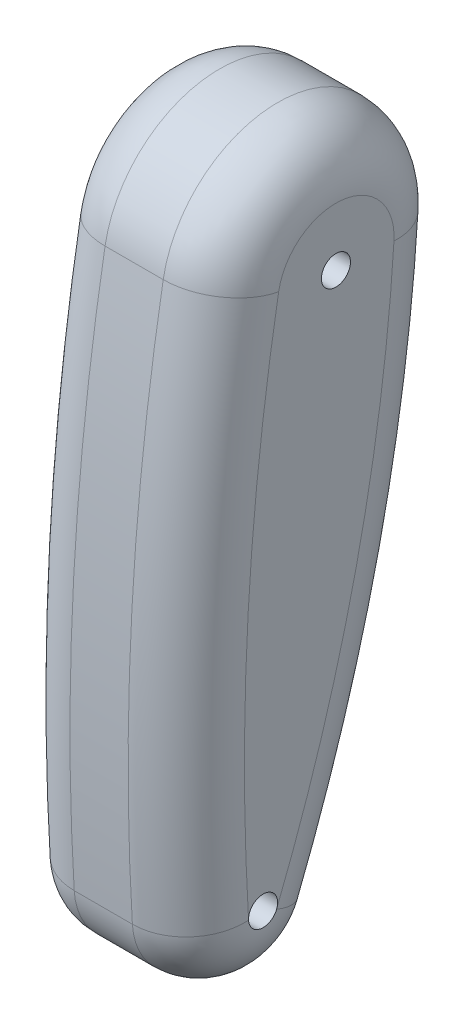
ISO-10303-21;
HEADER;
FILE_DESCRIPTION(('STEP AP214'),'2;1');
FILE_NAME('part.step','',(''),(''),'','','');
FILE_SCHEMA(('AUTOMOTIVE_DESIGN { 1 0 10303 214 1 1 1 1 }'));
ENDSEC;
DATA;
#1=APPLICATION_CONTEXT('core data for automotive mechanical design processes');
#2=APPLICATION_PROTOCOL_DEFINITION('international standard','automotive_design',2000,#1);
#3=PRODUCT_CONTEXT('',#1,'mechanical');
#4=PRODUCT('Part','Part','',(#3));
#5=PRODUCT_RELATED_PRODUCT_CATEGORY('part','',(#4));
#6=PRODUCT_DEFINITION_FORMATION('','',#4);
#7=PRODUCT_DEFINITION_CONTEXT('part definition',#1,'design');
#8=PRODUCT_DEFINITION('design','',#6,#7);
#9=PRODUCT_DEFINITION_SHAPE('','',#8);
#10=(LENGTH_UNIT() NAMED_UNIT(*) SI_UNIT(.MILLI.,.METRE.));
#11=(NAMED_UNIT(*) PLANE_ANGLE_UNIT() SI_UNIT($,.RADIAN.));
#12=(NAMED_UNIT(*) SI_UNIT($,.STERADIAN.) SOLID_ANGLE_UNIT());
#13=UNCERTAINTY_MEASURE_WITH_UNIT(LENGTH_MEASURE(1.E-05),#10,'distance_accuracy_value','');
#14=(GEOMETRIC_REPRESENTATION_CONTEXT(3) GLOBAL_UNCERTAINTY_ASSIGNED_CONTEXT((#13)) GLOBAL_UNIT_ASSIGNED_CONTEXT((#10,
#11,#12)) REPRESENTATION_CONTEXT('',''));
#15=CARTESIAN_POINT('',(0.,0.,0.));
#16=DIRECTION('',(0.,0.,1.));
#17=DIRECTION('',(1.,0.,0.));
#18=AXIS2_PLACEMENT_3D('',#15,#16,#17);
#19=CARTESIAN_POINT('',(76.1999999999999,-334.004095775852,-1901.28520322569));
#20=DIRECTION('',(-1.,0.,0.));
#21=DIRECTION('',(0.,0.,1.));
#22=AXIS2_PLACEMENT_3D('',#19,#20,#21);
#23=CYLINDRICAL_SURFACE('',#22,2032.);
#24=DIRECTION('',(-1.,0.,0.));
#25=VECTOR('',#24,1.);
#26=CARTESIAN_POINT('',(76.1999999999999,17.5791629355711,100.067642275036));
#27=LINE('',#26,#25);
#28=CARTESIAN_POINT('',(25.3999999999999,17.5791629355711,100.067642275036));
#29=VERTEX_POINT('',#28);
#30=CARTESIAN_POINT('',(-25.3999999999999,17.5791629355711,100.067642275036));
#31=VERTEX_POINT('',#30);
#32=EDGE_CURVE('E156',#29,#31,#27,.T.);
#33=ORIENTED_EDGE('',*,*,#32,.T.);
#34=CARTESIAN_POINT('',(-25.3999999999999,-334.004095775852,-1901.28520322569));
#35=DIRECTION('',(-1.,0.,0.));
#36=DIRECTION('',(0.,0.,1.));
#37=AXIS2_PLACEMENT_3D('',#34,#35,#36);
#38=CIRCLE('',#37,2032.);
#39=CARTESIAN_POINT('',(-25.3999999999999,-456.581092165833,127.014301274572));
#40=VERTEX_POINT('',#39);
#41=EDGE_CURVE('E121',#31,#40,#38,.F.);
#42=ORIENTED_EDGE('',*,*,#41,.T.);
#43=DIRECTION('',(-1.,0.,0.));
#44=VECTOR('',#43,1.);
#45=CARTESIAN_POINT('',(76.1999999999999,-456.581092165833,127.014301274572));
#46=LINE('',#45,#44);
#47=CARTESIAN_POINT('',(25.3999999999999,-456.581092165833,127.014301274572));
#48=VERTEX_POINT('',#47);
#49=EDGE_CURVE('E147',#48,#40,#46,.T.);
#50=ORIENTED_EDGE('',*,*,#49,.F.);
#51=CARTESIAN_POINT('',(25.3999999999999,-334.004095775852,-1901.28520322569));
#52=DIRECTION('',(-1.,0.,0.));
#53=DIRECTION('',(0.,0.,1.));
#54=AXIS2_PLACEMENT_3D('',#51,#52,#53);
#55=CIRCLE('',#54,2032.);
#56=EDGE_CURVE('E123',#48,#29,#55,.T.);
#57=ORIENTED_EDGE('',*,*,#56,.T.);
#58=EDGE_LOOP('',(#33,#42,#50,#57));
#59=FACE_BOUND('',#58,.T.);
#60=ADVANCED_FACE('F31',(#59),#23,.T.);
#61=CARTESIAN_POINT('',(76.1999999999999,-452.750561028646,63.6299417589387));
#62=DIRECTION('',(-1.,0.,0.));
#63=DIRECTION('',(0.,0.,1.));
#64=AXIS2_PLACEMENT_3D('',#61,#62,#63);
#65=CYLINDRICAL_SURFACE('',#64,63.5000000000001);
#66=ORIENTED_EDGE('',*,*,#49,.T.);
#67=CARTESIAN_POINT('',(-25.3999999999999,-452.750561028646,63.6299417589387));
#68=DIRECTION('',(-1.,0.,0.));
#69=DIRECTION('',(0.,0.,1.));
#70=AXIS2_PLACEMENT_3D('',#67,#68,#69);
#71=CIRCLE('',#70,63.5000000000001);
#72=CARTESIAN_POINT('',(-25.3999999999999,-476.346664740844,4.67679180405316));
#73=VERTEX_POINT('',#72);
#74=EDGE_CURVE('E143',#40,#73,#71,.F.);
#75=ORIENTED_EDGE('',*,*,#74,.T.);
#76=DIRECTION('',(-1.,0.,0.));
#77=VECTOR('',#76,1.);
#78=CARTESIAN_POINT('',(76.1999999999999,-476.346664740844,4.67679180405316));
#79=LINE('',#78,#77);
#80=CARTESIAN_POINT('',(25.3999999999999,-476.346664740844,4.67679180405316));
#81=VERTEX_POINT('',#80);
#82=EDGE_CURVE('E150',#81,#73,#79,.T.);
#83=ORIENTED_EDGE('',*,*,#82,.F.);
#84=CARTESIAN_POINT('',(25.3999999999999,-452.750561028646,63.6299417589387));
#85=DIRECTION('',(-1.,0.,0.));
#86=DIRECTION('',(0.,0.,1.));
#87=AXIS2_PLACEMENT_3D('',#84,#85,#86);
#88=CIRCLE('',#87,63.5000000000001);
#89=EDGE_CURVE('E110',#81,#48,#88,.T.);
#90=ORIENTED_EDGE('',*,*,#89,.T.);
#91=EDGE_LOOP('',(#66,#75,#83,#90));
#92=FACE_BOUND('',#91,.T.);
#93=ADVANCED_FACE('F199',(#92),#65,.T.);
#94=CARTESIAN_POINT('',(76.1999999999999,89.9598243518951,1419.55239072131));
#95=DIRECTION('',(-1.,0.,0.));
#96=DIRECTION('',(0.,0.,1.));
#97=AXIS2_PLACEMENT_3D('',#94,#95,#96);
#98=CYLINDRICAL_SURFACE('',#97,1524.);
#99=ORIENTED_EDGE('',*,*,#82,.T.);
#100=CARTESIAN_POINT('',(-25.3999999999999,89.9598243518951,1419.55239072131));
#101=DIRECTION('',(-1.,0.,0.));
#102=DIRECTION('',(0.,0.,1.));
#103=AXIS2_PLACEMENT_3D('',#100,#101,#102);
#104=CIRCLE('',#103,1524.);
#105=CARTESIAN_POINT('',(-25.3999999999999,-6.42570173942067,-101.396599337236));
#106=VERTEX_POINT('',#105);
#107=EDGE_CURVE('E130',#73,#106,#104,.F.);
#108=ORIENTED_EDGE('',*,*,#107,.T.);
#109=DIRECTION('',(-1.,0.,0.));
#110=VECTOR('',#109,1.);
#111=CARTESIAN_POINT('',(76.1999999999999,-6.42570173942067,-101.396599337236));
#112=LINE('',#111,#110);
#113=CARTESIAN_POINT('',(25.3999999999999,-6.42570173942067,-101.396599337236));
#114=VERTEX_POINT('',#113);
#115=EDGE_CURVE('E153',#114,#106,#112,.T.);
#116=ORIENTED_EDGE('',*,*,#115,.F.);
#117=CARTESIAN_POINT('',(25.3999999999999,89.9598243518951,1419.55239072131));
#118=DIRECTION('',(-1.,0.,0.));
#119=DIRECTION('',(0.,0.,1.));
#120=AXIS2_PLACEMENT_3D('',#117,#118,#119);
#121=CIRCLE('',#120,1524.);
#122=EDGE_CURVE('E132',#114,#81,#121,.T.);
#123=ORIENTED_EDGE('',*,*,#122,.T.);
#124=EDGE_LOOP('',(#99,#108,#116,#123));
#125=FACE_BOUND('',#124,.T.);
#126=ADVANCED_FACE('F201',(#125),#98,.T.);
#127=CARTESIAN_POINT('',(76.1999999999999,0.,0.));
#128=DIRECTION('',(-1.,0.,0.));
#129=DIRECTION('',(0.,0.,1.));
#130=AXIS2_PLACEMENT_3D('',#127,#128,#129);
#131=CYLINDRICAL_SURFACE('',#130,101.6);
#132=ORIENTED_EDGE('',*,*,#115,.T.);
#133=CARTESIAN_POINT('',(-25.3999999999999,0.,0.));
#134=DIRECTION('',(-1.,0.,0.));
#135=DIRECTION('',(0.,0.,1.));
#136=AXIS2_PLACEMENT_3D('',#133,#134,#135);
#137=CIRCLE('',#136,101.6);
#138=EDGE_CURVE('E125',#106,#31,#137,.F.);
#139=ORIENTED_EDGE('',*,*,#138,.T.);
#140=ORIENTED_EDGE('',*,*,#32,.F.);
#141=CARTESIAN_POINT('',(25.3999999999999,0.,0.));
#142=DIRECTION('',(-1.,0.,0.));
#143=DIRECTION('',(0.,0.,1.));
#144=AXIS2_PLACEMENT_3D('',#141,#142,#143);
#145=CIRCLE('',#144,101.6);
#146=EDGE_CURVE('E127',#29,#114,#145,.T.);
#147=ORIENTED_EDGE('',*,*,#146,.T.);
#148=EDGE_LOOP('',(#132,#139,#140,#147));
#149=FACE_BOUND('',#148,.T.);
#150=ADVANCED_FACE('F205',(#149),#131,.T.);
#151=CARTESIAN_POINT('',(76.1999999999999,-167.002047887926,-950.642601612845));
#152=DIRECTION('',(-1.,0.,0.));
#153=DIRECTION('',(0.,0.,1.));
#154=AXIS2_PLACEMENT_3D('',#151,#152,#153);
#155=PLANE('',#154);
#156=CARTESIAN_POINT('',(76.1999999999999,0.,0.));
#157=DIRECTION('',(-1.,0.,0.));
#158=DIRECTION('',(0.,0.,1.));
#159=AXIS2_PLACEMENT_3D('',#156,#157,#158);
#160=CIRCLE('',#159,12.7);
#161=CARTESIAN_POINT('',(76.1999999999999,0.,12.7));
#162=VERTEX_POINT('',#161);
#163=EDGE_CURVE('E173',#162,#162,#160,.T.);
#164=ORIENTED_EDGE('',*,*,#163,.T.);
#165=EDGE_LOOP('',(#164));
#166=FACE_BOUND('',#165,.T.);
#167=CARTESIAN_POINT('',(76.1999999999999,-334.004095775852,-1901.28520322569));
#168=DIRECTION('',(-1.,0.,0.));
#169=DIRECTION('',(0.,0.,1.));
#170=AXIS2_PLACEMENT_3D('',#167,#168,#169);
#171=CIRCLE('',#170,1981.2);
#172=CARTESIAN_POINT('',(76.1999999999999,8.78958146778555,50.0338211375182));
#173=VERTEX_POINT('',#172);
#174=CARTESIAN_POINT('',(76.1999999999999,-453.516667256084,76.3068136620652));
#175=VERTEX_POINT('',#174);
#176=EDGE_CURVE('E99',#173,#175,#171,.F.);
#177=ORIENTED_EDGE('',*,*,#176,.T.);
#178=CARTESIAN_POINT('',(76.1999999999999,-452.750561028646,63.6299417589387));
#179=DIRECTION('',(-1.,0.,0.));
#180=DIRECTION('',(0.,0.,1.));
#181=AXIS2_PLACEMENT_3D('',#178,#179,#180);
#182=CIRCLE('',#181,12.7);
#183=CARTESIAN_POINT('',(76.1999999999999,-457.469781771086,51.8393117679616));
#184=VERTEX_POINT('',#183);
#185=EDGE_CURVE('E49',#175,#184,#182,.T.);
#186=ORIENTED_EDGE('',*,*,#185,.T.);
#187=CARTESIAN_POINT('',(76.1999999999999,89.9598243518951,1419.55239072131));
#188=DIRECTION('',(-1.,0.,0.));
#189=DIRECTION('',(0.,0.,1.));
#190=AXIS2_PLACEMENT_3D('',#187,#188,#189);
#191=CIRCLE('',#190,1473.2);
#192=CARTESIAN_POINT('',(76.1999999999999,-3.21285086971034,-50.6982996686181));
#193=VERTEX_POINT('',#192);
#194=EDGE_CURVE('E38',#184,#193,#191,.F.);
#195=ORIENTED_EDGE('',*,*,#194,.T.);
#196=CARTESIAN_POINT('',(76.1999999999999,0.,0.));
#197=DIRECTION('',(-1.,0.,0.));
#198=DIRECTION('',(0.,0.,1.));
#199=AXIS2_PLACEMENT_3D('',#196,#197,#198);
#200=CIRCLE('',#199,50.8);
#201=EDGE_CURVE('E11',#193,#173,#200,.F.);
#202=ORIENTED_EDGE('',*,*,#201,.T.);
#203=EDGE_LOOP('',(#177,#186,#195,#202));
#204=FACE_BOUND('',#203,.T.);
#205=ADVANCED_FACE('F101',(#166,#204),#155,.F.);
#206=CARTESIAN_POINT('',(-76.1999999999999,-167.002047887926,-950.642601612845));
#207=DIRECTION('',(-1.,0.,0.));
#208=DIRECTION('',(0.,0.,1.));
#209=AXIS2_PLACEMENT_3D('',#206,#207,#208);
#210=PLANE('',#209);
#211=CARTESIAN_POINT('',(-76.1999999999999,-452.750561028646,63.6299417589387));
#212=DIRECTION('',(-1.,0.,0.));
#213=DIRECTION('',(0.,0.,1.));
#214=AXIS2_PLACEMENT_3D('',#211,#212,#213);
#215=CIRCLE('',#214,12.7);
#216=CARTESIAN_POINT('',(-76.1999999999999,-453.516667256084,76.3068136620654));
#217=VERTEX_POINT('',#216);
#218=CARTESIAN_POINT('',(-76.1999999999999,-457.469781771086,51.8393117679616));
#219=VERTEX_POINT('',#218);
#220=EDGE_CURVE('E104',#217,#219,#215,.T.);
#221=ORIENTED_EDGE('',*,*,#220,.F.);
#222=CARTESIAN_POINT('',(-76.1999999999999,-334.004095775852,-1901.28520322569));
#223=DIRECTION('',(-1.,0.,0.));
#224=DIRECTION('',(0.,0.,1.));
#225=AXIS2_PLACEMENT_3D('',#222,#223,#224);
#226=CIRCLE('',#225,1981.2);
#227=CARTESIAN_POINT('',(-76.1999999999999,8.78958146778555,50.0338211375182));
#228=VERTEX_POINT('',#227);
#229=EDGE_CURVE('E141',#217,#228,#226,.T.);
#230=ORIENTED_EDGE('',*,*,#229,.T.);
#231=CARTESIAN_POINT('',(-76.1999999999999,0.,0.));
#232=DIRECTION('',(-1.,0.,0.));
#233=DIRECTION('',(0.,0.,1.));
#234=AXIS2_PLACEMENT_3D('',#231,#232,#233);
#235=CIRCLE('',#234,50.8);
#236=CARTESIAN_POINT('',(-76.1999999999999,-3.21285086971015,-50.6982996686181));
#237=VERTEX_POINT('',#236);
#238=EDGE_CURVE('E139',#228,#237,#235,.T.);
#239=ORIENTED_EDGE('',*,*,#238,.T.);
#240=CARTESIAN_POINT('',(-76.1999999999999,89.9598243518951,1419.55239072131));
#241=DIRECTION('',(-1.,0.,0.));
#242=DIRECTION('',(0.,0.,1.));
#243=AXIS2_PLACEMENT_3D('',#240,#241,#242);
#244=CIRCLE('',#243,1473.2);
#245=EDGE_CURVE('E136',#237,#219,#244,.T.);
#246=ORIENTED_EDGE('',*,*,#245,.T.);
#247=EDGE_LOOP('',(#221,#230,#239,#246));
#248=FACE_BOUND('',#247,.T.);
#249=CARTESIAN_POINT('',(-76.1999999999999,0.,0.));
#250=DIRECTION('',(-1.,0.,0.));
#251=DIRECTION('',(0.,0.,1.));
#252=AXIS2_PLACEMENT_3D('',#249,#250,#251);
#253=CIRCLE('',#252,12.7);
#254=CARTESIAN_POINT('',(-76.1999999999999,0.,12.7));
#255=VERTEX_POINT('',#254);
#256=EDGE_CURVE('E103',#255,#255,#253,.T.);
#257=ORIENTED_EDGE('',*,*,#256,.F.);
#258=EDGE_LOOP('',(#257));
#259=FACE_BOUND('',#258,.T.);
#260=ADVANCED_FACE('F182',(#248,#259),#210,.T.);
#261=CARTESIAN_POINT('',(-25.3999999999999,0.,0.));
#262=DIRECTION('',(-1.,0.,0.));
#263=DIRECTION('',(0.,0.,1.));
#264=AXIS2_PLACEMENT_3D('',#261,#262,#263);
#265=DEGENERATE_TOROIDAL_SURFACE('',#264,50.8,50.8,.T.);
#266=CARTESIAN_POINT('',(-25.3999999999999,-3.21285086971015,-50.6982996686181));
#267=DIRECTION('',(0.,-0.997998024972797,0.0632450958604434));
#268=DIRECTION('',(0.,-0.0632450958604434,-0.997998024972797));
#269=AXIS2_PLACEMENT_3D('',#266,#267,#268);
#270=CIRCLE('',#269,50.8);
#271=EDGE_CURVE('E162',#237,#106,#270,.T.);
#272=ORIENTED_EDGE('',*,*,#271,.F.);
#273=ORIENTED_EDGE('',*,*,#238,.F.);
#274=CARTESIAN_POINT('',(-25.3999999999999,8.78958146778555,50.0338211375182));
#275=DIRECTION('',(0.,-0.984917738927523,0.173023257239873));
#276=DIRECTION('',(0.,-0.173023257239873,-0.984917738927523));
#277=AXIS2_PLACEMENT_3D('',#274,#275,#276);
#278=CIRCLE('',#277,50.8);
#279=EDGE_CURVE('E159',#31,#228,#278,.T.);
#280=ORIENTED_EDGE('',*,*,#279,.F.);
#281=ORIENTED_EDGE('',*,*,#138,.F.);
#282=EDGE_LOOP('',(#272,#273,#280,#281));
#283=FACE_BOUND('',#282,.T.);
#284=ADVANCED_FACE('F219',(#283),#265,.T.);
#285=CARTESIAN_POINT('',(-25.3999999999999,-334.004095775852,-1901.28520322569));
#286=DIRECTION('',(-1.,0.,0.));
#287=DIRECTION('',(0.,0.,1.));
#288=AXIS2_PLACEMENT_3D('',#285,#286,#287);
#289=TOROIDAL_SURFACE('',#288,1981.2,50.8);
#290=ORIENTED_EDGE('',*,*,#279,.T.);
#291=ORIENTED_EDGE('',*,*,#229,.F.);
#292=CARTESIAN_POINT('',(-25.3999999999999,-453.516667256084,76.3068136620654));
#293=DIRECTION('',(0.,-0.998178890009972,-0.0603233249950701));
#294=DIRECTION('',(0.,0.0603233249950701,-0.998178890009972));
#295=AXIS2_PLACEMENT_3D('',#292,#293,#294);
#296=CIRCLE('',#295,50.8);
#297=EDGE_CURVE('E165',#40,#217,#296,.T.);
#298=ORIENTED_EDGE('',*,*,#297,.F.);
#299=ORIENTED_EDGE('',*,*,#41,.F.);
#300=EDGE_LOOP('',(#290,#291,#298,#299));
#301=FACE_BOUND('',#300,.T.);
#302=ADVANCED_FACE('F217',(#301),#289,.T.);
#303=CARTESIAN_POINT('',(-25.3999999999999,89.9598243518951,1419.55239072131));
#304=DIRECTION('',(-1.,0.,0.));
#305=DIRECTION('',(0.,0.,1.));
#306=AXIS2_PLACEMENT_3D('',#303,#304,#305);
#307=TOROIDAL_SURFACE('',#306,1473.2,50.8);
#308=ORIENTED_EDGE('',*,*,#271,.T.);
#309=ORIENTED_EDGE('',*,*,#107,.F.);
#310=CARTESIAN_POINT('',(-25.3999999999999,-457.469781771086,51.8393117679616));
#311=DIRECTION('',(0.,-0.928396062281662,0.371592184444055));
#312=DIRECTION('',(0.,-0.371592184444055,-0.928396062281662));
#313=AXIS2_PLACEMENT_3D('',#310,#311,#312);
#314=CIRCLE('',#313,50.8);
#315=EDGE_CURVE('E113',#219,#73,#314,.T.);
#316=ORIENTED_EDGE('',*,*,#315,.F.);
#317=ORIENTED_EDGE('',*,*,#245,.F.);
#318=EDGE_LOOP('',(#308,#309,#316,#317));
#319=FACE_BOUND('',#318,.T.);
#320=ADVANCED_FACE('F194',(#319),#307,.T.);
#321=CARTESIAN_POINT('',(-25.3999999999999,-452.750561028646,63.6299417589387));
#322=DIRECTION('',(-1.,0.,0.));
#323=DIRECTION('',(0.,0.,1.));
#324=AXIS2_PLACEMENT_3D('',#321,#322,#323);
#325=DEGENERATE_TOROIDAL_SURFACE('',#324,12.7000000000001,50.8,.T.);
#326=ORIENTED_EDGE('',*,*,#297,.T.);
#327=CARTESIAN_POINT('',(-76.1999999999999,-452.750561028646,63.6299417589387));
#328=DIRECTION('',(-1.,0.,0.));
#329=DIRECTION('',(0.,0.,1.));
#330=AXIS2_PLACEMENT_3D('',#327,#328,#329);
#331=CIRCLE('',#330,12.7000000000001);
#332=EDGE_CURVE('E134',#219,#217,#331,.T.);
#333=ORIENTED_EDGE('',*,*,#332,.F.);
#334=ORIENTED_EDGE('',*,*,#315,.T.);
#335=ORIENTED_EDGE('',*,*,#74,.F.);
#336=EDGE_LOOP('',(#326,#333,#334,#335));
#337=FACE_BOUND('',#336,.T.);
#338=ADVANCED_FACE('F189',(#337),#325,.T.);
#339=CARTESIAN_POINT('',(25.3999999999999,-452.750561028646,63.6299417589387));
#340=DIRECTION('',(-1.,0.,0.));
#341=DIRECTION('',(0.,0.,1.));
#342=AXIS2_PLACEMENT_3D('',#339,#340,#341);
#343=DEGENERATE_TOROIDAL_SURFACE('',#342,12.7000000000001,50.8,.T.);
#344=CARTESIAN_POINT('',(25.3999999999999,-453.516667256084,76.3068136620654));
#345=DIRECTION('',(0.,0.998178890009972,0.060323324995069));
#346=DIRECTION('',(0.,-0.060323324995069,0.998178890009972));
#347=AXIS2_PLACEMENT_3D('',#344,#345,#346);
#348=CIRCLE('',#347,50.8);
#349=EDGE_CURVE('E114',#48,#175,#348,.T.);
#350=ORIENTED_EDGE('',*,*,#349,.F.);
#351=ORIENTED_EDGE('',*,*,#89,.F.);
#352=CARTESIAN_POINT('',(25.3999999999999,-457.469781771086,51.8393117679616));
#353=DIRECTION('',(0.,0.928396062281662,-0.371592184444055));
#354=DIRECTION('',(0.,0.371592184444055,0.928396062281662));
#355=AXIS2_PLACEMENT_3D('',#352,#353,#354);
#356=CIRCLE('',#355,50.8);
#357=EDGE_CURVE('E108',#184,#81,#356,.T.);
#358=ORIENTED_EDGE('',*,*,#357,.F.);
#359=CARTESIAN_POINT('',(76.1999999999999,-452.750561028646,63.6299417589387));
#360=DIRECTION('',(-1.,0.,0.));
#361=DIRECTION('',(0.,0.,1.));
#362=AXIS2_PLACEMENT_3D('',#359,#360,#361);
#363=CIRCLE('',#362,12.7000000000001);
#364=EDGE_CURVE('E92',#175,#184,#363,.F.);
#365=ORIENTED_EDGE('',*,*,#364,.F.);
#366=EDGE_LOOP('',(#350,#351,#358,#365));
#367=FACE_BOUND('',#366,.T.);
#368=ADVANCED_FACE('F109',(#367),#343,.T.);
#369=CARTESIAN_POINT('',(25.3999999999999,89.9598243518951,1419.55239072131));
#370=DIRECTION('',(-1.,0.,0.));
#371=DIRECTION('',(0.,0.,1.));
#372=AXIS2_PLACEMENT_3D('',#369,#370,#371);
#373=TOROIDAL_SURFACE('',#372,1473.2,50.8);
#374=ORIENTED_EDGE('',*,*,#357,.T.);
#375=ORIENTED_EDGE('',*,*,#122,.F.);
#376=CARTESIAN_POINT('',(25.3999999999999,-3.21285086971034,-50.6982996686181));
#377=DIRECTION('',(0.,0.997998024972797,-0.0632450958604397));
#378=DIRECTION('',(0.,0.0632450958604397,0.997998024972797));
#379=AXIS2_PLACEMENT_3D('',#376,#377,#378);
#380=CIRCLE('',#379,50.8);
#381=EDGE_CURVE('E117',#193,#114,#380,.T.);
#382=ORIENTED_EDGE('',*,*,#381,.F.);
#383=ORIENTED_EDGE('',*,*,#194,.F.);
#384=EDGE_LOOP('',(#374,#375,#382,#383));
#385=FACE_BOUND('',#384,.T.);
#386=ADVANCED_FACE('F116',(#385),#373,.T.);
#387=CARTESIAN_POINT('',(25.3999999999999,-334.004095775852,-1901.28520322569));
#388=DIRECTION('',(-1.,0.,0.));
#389=DIRECTION('',(0.,0.,1.));
#390=AXIS2_PLACEMENT_3D('',#387,#388,#389);
#391=TOROIDAL_SURFACE('',#390,1981.2,50.8);
#392=ORIENTED_EDGE('',*,*,#349,.T.);
#393=ORIENTED_EDGE('',*,*,#176,.F.);
#394=CARTESIAN_POINT('',(25.3999999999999,8.78958146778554,50.0338211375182));
#395=DIRECTION('',(0.,0.984917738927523,-0.173023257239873));
#396=DIRECTION('',(0.,0.173023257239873,0.984917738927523));
#397=AXIS2_PLACEMENT_3D('',#394,#395,#396);
#398=CIRCLE('',#397,50.8);
#399=EDGE_CURVE('E171',#29,#173,#398,.T.);
#400=ORIENTED_EDGE('',*,*,#399,.F.);
#401=ORIENTED_EDGE('',*,*,#56,.F.);
#402=EDGE_LOOP('',(#392,#393,#400,#401));
#403=FACE_BOUND('',#402,.T.);
#404=ADVANCED_FACE('F212',(#403),#391,.T.);
#405=CARTESIAN_POINT('',(25.3999999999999,0.,0.));
#406=DIRECTION('',(-1.,0.,0.));
#407=DIRECTION('',(0.,0.,1.));
#408=AXIS2_PLACEMENT_3D('',#405,#406,#407);
#409=DEGENERATE_TOROIDAL_SURFACE('',#408,50.8,50.8,.T.);
#410=ORIENTED_EDGE('',*,*,#381,.T.);
#411=ORIENTED_EDGE('',*,*,#146,.F.);
#412=ORIENTED_EDGE('',*,*,#399,.T.);
#413=ORIENTED_EDGE('',*,*,#201,.F.);
#414=EDGE_LOOP('',(#410,#411,#412,#413));
#415=FACE_BOUND('',#414,.T.);
#416=ADVANCED_FACE('F209',(#415),#409,.T.);
#417=CARTESIAN_POINT('',(76.1999999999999,0.,0.));
#418=DIRECTION('',(-1.,0.,0.));
#419=DIRECTION('',(0.,0.,1.));
#420=AXIS2_PLACEMENT_3D('',#417,#418,#419);
#421=CYLINDRICAL_SURFACE('',#420,12.7);
#422=ORIENTED_EDGE('',*,*,#163,.F.);
#423=EDGE_LOOP('',(#422));
#424=FACE_BOUND('',#423,.T.);
#425=ORIENTED_EDGE('',*,*,#256,.T.);
#426=EDGE_LOOP('',(#425));
#427=FACE_BOUND('',#426,.T.);
#428=ADVANCED_FACE('F245',(#424,#427),#421,.F.);
#429=CARTESIAN_POINT('',(76.1999999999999,-452.750561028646,63.6299417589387));
#430=DIRECTION('',(-1.,0.,0.));
#431=DIRECTION('',(0.,0.,1.));
#432=AXIS2_PLACEMENT_3D('',#429,#430,#431);
#433=CYLINDRICAL_SURFACE('',#432,12.7);
#434=ORIENTED_EDGE('',*,*,#364,.T.);
#435=ORIENTED_EDGE('',*,*,#185,.F.);
#436=EDGE_LOOP('',(#434,#435));
#437=FACE_BOUND('',#436,.T.);
#438=ORIENTED_EDGE('',*,*,#332,.T.);
#439=ORIENTED_EDGE('',*,*,#220,.T.);
#440=EDGE_LOOP('',(#438,#439));
#441=FACE_BOUND('',#440,.T.);
#442=ADVANCED_FACE('F93',(#437,#441),#433,.F.);
#443=CLOSED_SHELL('',(#60,#93,#126,#150,#205,#260,#284,#302,#320,#338,#368,#386,#404,#416,#428,#442));
#444=MANIFOLD_SOLID_BREP('B2',#443);
#445=ADVANCED_BREP_SHAPE_REPRESENTATION('',(#18,#444),#14);
#446=SHAPE_DEFINITION_REPRESENTATION(#9,#445);
ENDSEC;
END-ISO-10303-21;
